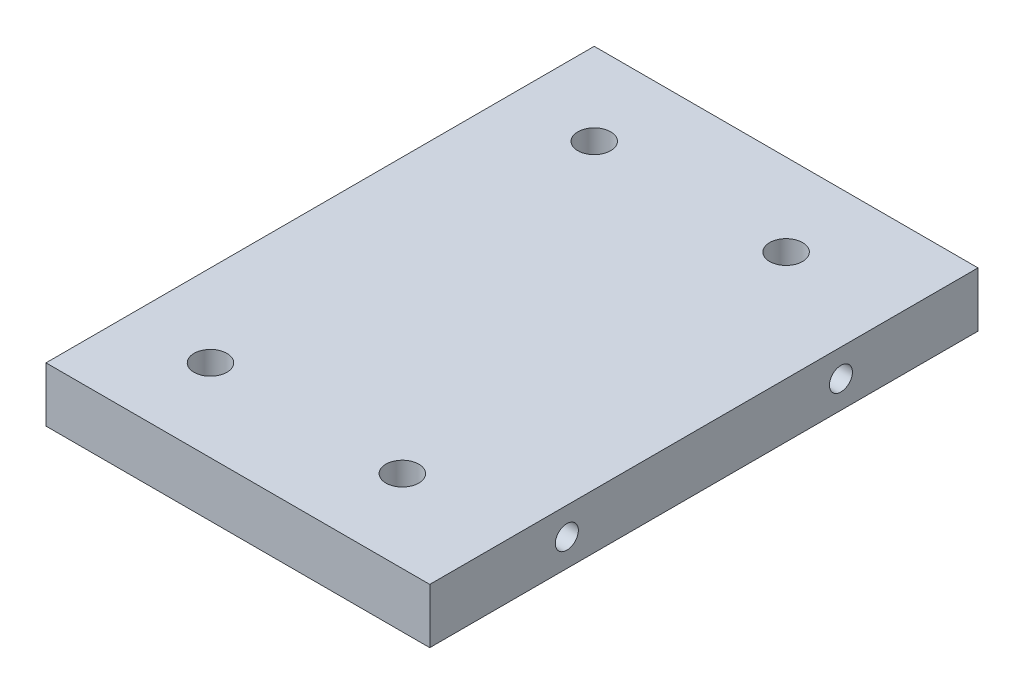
from build123d import *

# Parameters (mm, degrees)
ESQUISSE1_W               = 70
ESQUISSE1_H               = 10
BOSS_EXTRU_1_DEPTH        = 100
ESQUISSE2_R               = 3
ENL_V_MAT_EXTRU_1_DEPTH   = 123.474487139
TROU_TARAUD_M5X0_81_D     = 4.2
TROU_TARAUD_M5X0_81_DEPTH = 15
TROU_TARAUD_M5X0_81_TIP   = 1.2618073


with BuildPart() as part:
    # Esquisse1 → Boss.-Extru.1 (new body)
    with BuildSketch(Plane.XY):
        with Locations((35, 5)):
            Rectangle(ESQUISSE1_W, ESQUISSE1_H)
    extrude(amount=BOSS_EXTRU_1_DEPTH)

    # Esquisse2 → Enl_v. mat.-Extru.1 (cut, through all)
    with BuildSketch(Plane(origin=(0, 10, 0), x_dir=(1, 0, 0), z_dir=(0, 1, 0))):
        with Locations(Location((15, -15, 0), (0, 0, 270))):
            Circle(ESQUISSE2_R)
        with Locations(Location((50, -15, 0), (0, 0, 270))):
            Circle(ESQUISSE2_R)
        with Locations(Location((50, -85, 0), (0, 0, 270))):
            Circle(ESQUISSE2_R)
        with Locations(Location((15, -85, 0), (0, 0, 270))):
            Circle(ESQUISSE2_R)
    extrude(amount=-ENL_V_MAT_EXTRU_1_DEPTH, mode=Mode.SUBTRACT)

    # Trou taraud_ M5x0.81
    with Locations(Plane(origin=(70, 0, 0), x_dir=(0, 0, -1), z_dir=(1, 0, 0))):
        with Locations((-75, 5), (-25, 5)):
            Hole(TROU_TARAUD_M5X0_81_D / 2, depth=TROU_TARAUD_M5X0_81_DEPTH)
            with Locations((0, 0, -(TROU_TARAUD_M5X0_81_DEPTH + TROU_TARAUD_M5X0_81_TIP / 2))):  # 118° drill point
                Cone(0, TROU_TARAUD_M5X0_81_D / 2, TROU_TARAUD_M5X0_81_TIP, mode=Mode.SUBTRACT)


solid = part.part
